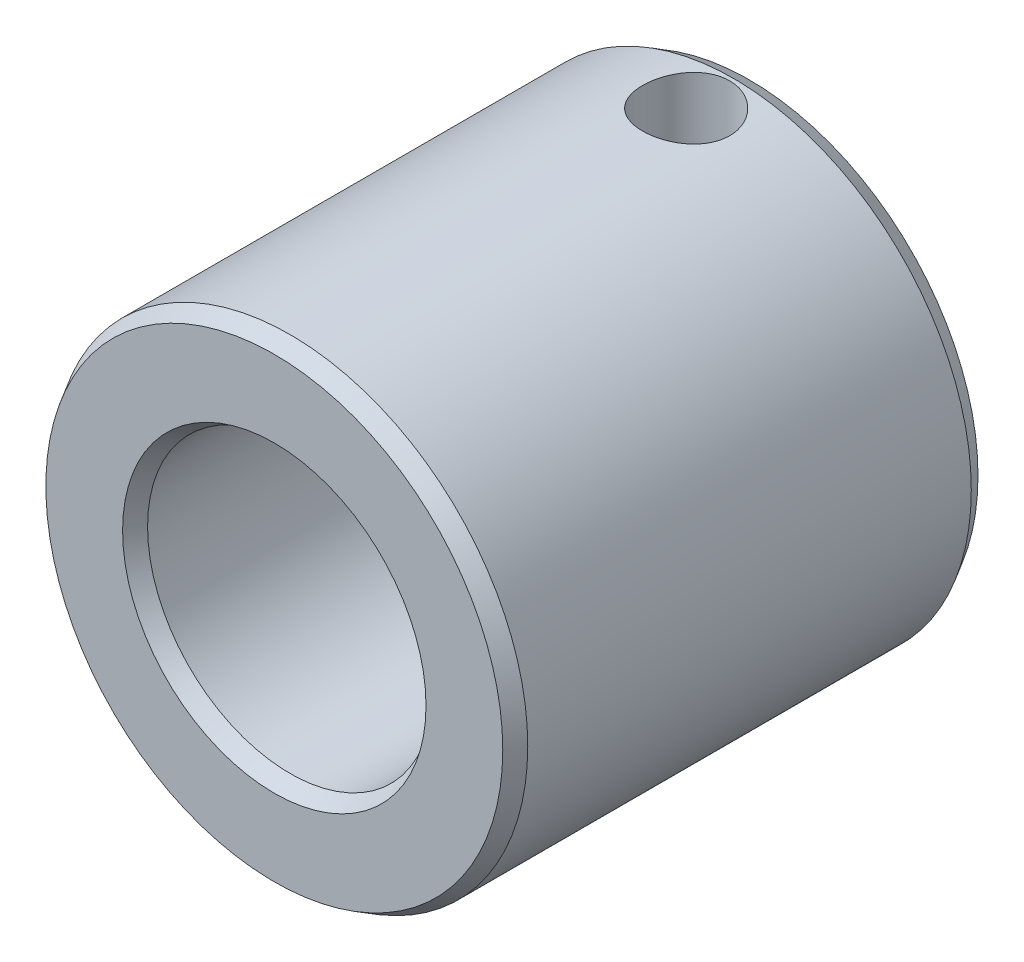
ISO-10303-21;
HEADER;
FILE_DESCRIPTION(('STEP AP214'),'2;1');
FILE_NAME('part.step','',(''),(''),'','','');
FILE_SCHEMA(('AUTOMOTIVE_DESIGN { 1 0 10303 214 1 1 1 1 }'));
ENDSEC;
DATA;
#1=APPLICATION_CONTEXT('core data for automotive mechanical design processes');
#2=APPLICATION_PROTOCOL_DEFINITION('international standard','automotive_design',2000,#1);
#3=PRODUCT_CONTEXT('',#1,'mechanical');
#4=PRODUCT('Part','Part','',(#3));
#5=PRODUCT_RELATED_PRODUCT_CATEGORY('part','',(#4));
#6=PRODUCT_DEFINITION_FORMATION('','',#4);
#7=PRODUCT_DEFINITION_CONTEXT('part definition',#1,'design');
#8=PRODUCT_DEFINITION('design','',#6,#7);
#9=PRODUCT_DEFINITION_SHAPE('','',#8);
#10=(LENGTH_UNIT() NAMED_UNIT(*) SI_UNIT(.MILLI.,.METRE.));
#11=(NAMED_UNIT(*) PLANE_ANGLE_UNIT() SI_UNIT($,.RADIAN.));
#12=(NAMED_UNIT(*) SI_UNIT($,.STERADIAN.) SOLID_ANGLE_UNIT());
#13=UNCERTAINTY_MEASURE_WITH_UNIT(LENGTH_MEASURE(1.E-05),#10,'distance_accuracy_value','');
#14=(GEOMETRIC_REPRESENTATION_CONTEXT(3) GLOBAL_UNCERTAINTY_ASSIGNED_CONTEXT((#13)) GLOBAL_UNIT_ASSIGNED_CONTEXT((#10,
#11,#12)) REPRESENTATION_CONTEXT('',''));
#15=CARTESIAN_POINT('',(0.,0.,0.));
#16=DIRECTION('',(0.,0.,1.));
#17=DIRECTION('',(1.,0.,0.));
#18=AXIS2_PLACEMENT_3D('',#15,#16,#17);
#19=CARTESIAN_POINT('',(0.,0.,35.094868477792));
#20=DIRECTION('',(0.,0.,1.));
#21=DIRECTION('',(1.,0.,0.));
#22=AXIS2_PLACEMENT_3D('',#19,#20,#21);
#23=CYLINDRICAL_SURFACE('',#22,9.);
#24=CARTESIAN_POINT('',(0.,0.,29.));
#25=DIRECTION('',(0.,0.,1.));
#26=DIRECTION('',(1.,0.,0.));
#27=AXIS2_PLACEMENT_3D('',#24,#25,#26);
#28=CIRCLE('',#27,9.);
#29=CARTESIAN_POINT('',(9.,0.,29.));
#30=VERTEX_POINT('',#29);
#31=EDGE_CURVE('E29',#30,#30,#28,.T.);
#32=ORIENTED_EDGE('',*,*,#31,.T.);
#33=EDGE_LOOP('',(#32));
#34=FACE_BOUND('',#33,.T.);
#35=CARTESIAN_POINT('',(0.,0.,1.));
#36=DIRECTION('',(0.,0.,1.));
#37=DIRECTION('',(1.,0.,0.));
#38=AXIS2_PLACEMENT_3D('',#35,#36,#37);
#39=CIRCLE('',#38,9.);
#40=CARTESIAN_POINT('',(9.,0.,1.));
#41=VERTEX_POINT('',#40);
#42=EDGE_CURVE('E34',#41,#41,#39,.T.);
#43=ORIENTED_EDGE('',*,*,#42,.F.);
#44=EDGE_LOOP('',(#43));
#45=FACE_BOUND('',#44,.T.);
#46=CARTESIAN_POINT('',(0.,9.,6.75));
#47=CARTESIAN_POINT('',(0.150732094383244,8.99999893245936,6.74999853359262));
#48=CARTESIAN_POINT('',(0.301479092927,8.9961773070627,6.73756620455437));
#49=CARTESIAN_POINT('',(0.598575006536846,8.98130590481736,6.68828880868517));
#50=CARTESIAN_POINT('',(0.744922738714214,8.97025420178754,6.6514372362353));
#51=CARTESIAN_POINT('',(1.02889246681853,8.94213200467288,6.55467260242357));
#52=CARTESIAN_POINT('',(1.16652725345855,8.92507058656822,6.49479430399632));
#53=CARTESIAN_POINT('',(1.42980304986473,8.88669712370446,6.35382085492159));
#54=CARTESIAN_POINT('',(1.55544232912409,8.86538446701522,6.27272264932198));
#55=CARTESIAN_POINT('',(1.7948886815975,8.82006981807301,6.08907720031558));
#56=CARTESIAN_POINT('',(1.90828973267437,8.79601116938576,5.98601458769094));
#57=CARTESIAN_POINT('',(2.11649716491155,8.74824972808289,5.76246382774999));
#58=CARTESIAN_POINT('',(2.21130027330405,8.72454699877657,5.64197261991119));
#59=CARTESIAN_POINT('',(2.38178581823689,8.67957795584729,5.38351455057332));
#60=CARTESIAN_POINT('',(2.45696755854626,8.658381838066,5.24520405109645));
#61=CARTESIAN_POINT('',(2.58283736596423,8.62167505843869,4.95715067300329));
#62=CARTESIAN_POINT('',(2.63353156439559,8.60616297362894,4.80741066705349));
#63=CARTESIAN_POINT('',(2.70751366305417,8.58317198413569,4.50531810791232));
#64=CARTESIAN_POINT('',(2.73155215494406,8.575473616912,4.35316653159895));
#65=CARTESIAN_POINT('',(2.75388480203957,8.56832938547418,4.04681021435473));
#66=CARTESIAN_POINT('',(2.75218545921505,8.56888143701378,3.89260600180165));
#67=CARTESIAN_POINT('',(2.7236791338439,8.57798150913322,3.59267144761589));
#68=CARTESIAN_POINT('',(2.69781854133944,8.58622811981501,3.44684048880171));
#69=CARTESIAN_POINT('',(2.62325522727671,8.60929961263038,3.16169483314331));
#70=CARTESIAN_POINT('',(2.57455017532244,8.62412516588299,3.02238080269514));
#71=CARTESIAN_POINT('',(2.45499611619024,8.65892040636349,2.75193535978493));
#72=CARTESIAN_POINT('',(2.38384448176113,8.67895969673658,2.62094706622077));
#73=CARTESIAN_POINT('',(2.22162725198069,8.7218917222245,2.37245516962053));
#74=CARTESIAN_POINT('',(2.13055667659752,8.74478517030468,2.25495495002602));
#75=CARTESIAN_POINT('',(1.92641124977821,8.79206258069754,2.03141446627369));
#76=CARTESIAN_POINT('',(1.81255281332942,8.8164681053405,1.92609309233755));
#77=CARTESIAN_POINT('',(1.56848594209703,8.86314096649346,1.73586853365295));
#78=CARTESIAN_POINT('',(1.43827640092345,8.88540815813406,1.6509667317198));
#79=CARTESIAN_POINT('',(1.1638622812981,8.92551194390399,1.50353273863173));
#80=CARTESIAN_POINT('',(1.01956405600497,8.94331562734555,1.44116529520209));
#81=CARTESIAN_POINT('',(0.721855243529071,8.9722490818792,1.34179925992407));
#82=CARTESIAN_POINT('',(0.56844731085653,8.98338078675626,1.30479331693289));
#83=CARTESIAN_POINT('',(0.2629811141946,8.99740784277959,1.2584097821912));
#84=CARTESIAN_POINT('',(0.111083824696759,9.00059336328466,1.24805837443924));
#85=CARTESIAN_POINT('',(-0.192290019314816,8.99922345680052,1.25254115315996));
#86=CARTESIAN_POINT('',(-0.343766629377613,8.99466910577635,1.26737183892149));
#87=CARTESIAN_POINT('',(-0.638288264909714,8.97852146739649,1.32101283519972));
#88=CARTESIAN_POINT('',(-0.781447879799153,8.96709666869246,1.35924953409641));
#89=CARTESIAN_POINT('',(-1.05928473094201,8.93853661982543,1.45792271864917));
#90=CARTESIAN_POINT('',(-1.19396093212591,8.92140067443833,1.51836190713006));
#91=CARTESIAN_POINT('',(-1.45455502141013,8.88268238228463,1.6613294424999));
#92=CARTESIAN_POINT('',(-1.58018976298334,8.86100429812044,1.74434726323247));
#93=CARTESIAN_POINT('',(-1.81607444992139,8.81568626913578,1.92952405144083));
#94=CARTESIAN_POINT('',(-1.92632038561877,8.79204581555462,2.03168799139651));
#95=CARTESIAN_POINT('',(-2.13261647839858,8.7443462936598,2.25683479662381));
#96=CARTESIAN_POINT('',(-2.22797320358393,8.72030513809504,2.38045823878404));
#97=CARTESIAN_POINT('',(-2.3966426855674,8.67546813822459,2.64247476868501));
#98=CARTESIAN_POINT('',(-2.46995592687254,8.65467222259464,2.78086753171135));
#99=CARTESIAN_POINT('',(-2.59197431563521,8.61891634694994,3.06811811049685));
#100=CARTESIAN_POINT('',(-2.64078616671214,8.60393114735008,3.21692727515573));
#101=CARTESIAN_POINT('',(-2.71250039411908,8.58159540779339,3.52119990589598));
#102=CARTESIAN_POINT('',(-2.7354120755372,8.57424212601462,3.67666096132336));
#103=CARTESIAN_POINT('',(-2.75402711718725,8.56827980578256,3.98260089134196));
#104=CARTESIAN_POINT('',(-2.75086398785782,8.56930645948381,4.13300457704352));
#105=CARTESIAN_POINT('',(-2.72013837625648,8.57910842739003,4.43102834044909));
#106=CARTESIAN_POINT('',(-2.69257694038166,8.58788340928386,4.57864853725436));
#107=CARTESIAN_POINT('',(-2.61458088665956,8.61194440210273,4.86498559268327));
#108=CARTESIAN_POINT('',(-2.5644570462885,8.62714178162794,5.0037951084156));
#109=CARTESIAN_POINT('',(-2.44300207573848,8.66231608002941,5.27114514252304));
#110=CARTESIAN_POINT('',(-2.37166677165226,8.68229393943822,5.39968363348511));
#111=CARTESIAN_POINT('',(-2.20667281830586,8.72571614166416,5.64807568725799));
#112=CARTESIAN_POINT('',(-2.11227528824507,8.74926262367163,5.76742056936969));
#113=CARTESIAN_POINT('',(-1.90515328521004,8.79668470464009,5.98894305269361));
#114=CARTESIAN_POINT('',(-1.79242399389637,8.82056038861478,6.0911161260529));
#115=CARTESIAN_POINT('',(-1.547669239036,8.86683031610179,6.27852900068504));
#116=CARTESIAN_POINT('',(-1.41515737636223,8.88915651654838,6.36315217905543));
#117=CARTESIAN_POINT('',(-1.13710535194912,8.92897904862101,6.50880379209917));
#118=CARTESIAN_POINT('',(-0.991570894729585,8.94647748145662,6.56984249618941));
#119=CARTESIAN_POINT('',(-0.706221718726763,8.97328009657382,6.66157536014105));
#120=CARTESIAN_POINT('',(-0.567225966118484,8.9832154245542,6.69464227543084));
#121=CARTESIAN_POINT('',(-0.285490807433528,8.99657528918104,6.73885329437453));
#122=CARTESIAN_POINT('',(-0.142752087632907,9.00000101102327,6.75000138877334));
#123=CARTESIAN_POINT('',(0.,9.,6.75));
#124=B_SPLINE_CURVE_WITH_KNOTS('',3,(#46,#47,#48,#49,#50,#51,#52,#53,#54,#55,#56,#57,#58,#59,
#60,#61,#62,#63,#64,#65,#66,#67,#68,#69,#70,#71,#72,#73,#74,#75,#76,#77,#78,#79,#80,#81,#82,#83,
#84,#85,#86,#87,#88,#89,#90,#91,#92,#93,#94,#95,#96,#97,#98,#99,#100,#101,#102,#103,#104,#105,
#106,#107,#108,#109,#110,#111,#112,#113,#114,#115,#116,#117,#118,#119,#120,#121,#122,#123),
.UNSPECIFIED.,.T.,.F.,(4,2,2,2,2,2,2,2,2,2,2,2,2,2,2,2,2,2,2,2,2,2,2,2,2,2,2,2,2,2,2,2,2,2,2,2,
2,2,4),(0.,0.451671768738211,0.903463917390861,1.3545766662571,1.80575439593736,
2.26899159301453,2.73231023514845,3.20649731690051,3.68056560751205,4.14091608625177,
4.60115027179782,5.04408074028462,5.48705640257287,5.93627973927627,6.38561551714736,
6.85445681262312,7.3233298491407,7.79556456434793,8.26766234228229,8.72225023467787,
9.17677493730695,9.62058331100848,10.0644457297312,10.518825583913,10.973323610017,
11.444987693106,11.9166414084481,12.3862228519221,12.8556355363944,13.3047534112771,
13.7538520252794,14.1969455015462,14.6401262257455,15.0999803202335,15.5599554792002,
16.0340612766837,16.5079604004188,16.9357978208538,17.3635573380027),.UNSPECIFIED.);
#125=CARTESIAN_POINT('',(0.,9.,6.75));
#126=VERTEX_POINT('',#125);
#127=EDGE_CURVE('E49',#126,#126,#124,.T.);
#128=ORIENTED_EDGE('',*,*,#127,.T.);
#129=EDGE_LOOP('',(#128));
#130=FACE_BOUND('',#129,.T.);
#131=ADVANCED_FACE('F12',(#34,#45,#130),#23,.F.);
#132=CARTESIAN_POINT('',(0.,0.,35.094868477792));
#133=DIRECTION('',(0.,0.,1.));
#134=DIRECTION('',(1.,0.,0.));
#135=AXIS2_PLACEMENT_3D('',#132,#133,#134);
#136=CYLINDRICAL_SURFACE('',#135,15.);
#137=CARTESIAN_POINT('',(0.,0.,29.));
#138=DIRECTION('',(0.,0.,1.));
#139=DIRECTION('',(1.,0.,0.));
#140=AXIS2_PLACEMENT_3D('',#137,#138,#139);
#141=CIRCLE('',#140,15.);
#142=CARTESIAN_POINT('',(15.,0.,29.));
#143=VERTEX_POINT('',#142);
#144=EDGE_CURVE('E46',#143,#143,#141,.T.);
#145=ORIENTED_EDGE('',*,*,#144,.F.);
#146=EDGE_LOOP('',(#145));
#147=FACE_BOUND('',#146,.T.);
#148=CARTESIAN_POINT('',(0.,0.,1.));
#149=DIRECTION('',(0.,0.,1.));
#150=DIRECTION('',(1.,0.,0.));
#151=AXIS2_PLACEMENT_3D('',#148,#149,#150);
#152=CIRCLE('',#151,15.);
#153=CARTESIAN_POINT('',(15.,0.,1.));
#154=VERTEX_POINT('',#153);
#155=EDGE_CURVE('E43',#154,#154,#152,.T.);
#156=ORIENTED_EDGE('',*,*,#155,.T.);
#157=EDGE_LOOP('',(#156));
#158=FACE_BOUND('',#157,.T.);
#159=CARTESIAN_POINT('',(0.,15.,6.75));
#160=CARTESIAN_POINT('',(-0.153093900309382,14.9999972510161,6.74999408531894));
#161=CARTESIAN_POINT('',(-0.30626547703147,14.9976319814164,6.73717257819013));
#162=CARTESIAN_POINT('',(-0.608296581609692,14.9884243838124,6.68625588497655));
#163=CARTESIAN_POINT('',(-0.757152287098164,14.9815782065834,6.64813896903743));
#164=CARTESIAN_POINT('',(-1.04613957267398,14.9641750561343,6.54783432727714));
#165=CARTESIAN_POINT('',(-1.18627875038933,14.9536213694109,6.48566791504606));
#166=CARTESIAN_POINT('',(-1.45412377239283,14.9299573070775,6.3390885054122));
#167=CARTESIAN_POINT('',(-1.58183070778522,14.9168471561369,6.25467746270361));
#168=CARTESIAN_POINT('',(-1.82266517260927,14.8893503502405,6.06497648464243));
#169=CARTESIAN_POINT('',(-1.93562942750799,14.8749519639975,5.95948094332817));
#170=CARTESIAN_POINT('',(-2.1423598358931,14.846589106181,5.73104795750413));
#171=CARTESIAN_POINT('',(-2.23612464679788,14.8326246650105,5.60810929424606));
#172=CARTESIAN_POINT('',(-2.40246850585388,14.806596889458,5.34713263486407));
#173=CARTESIAN_POINT('',(-2.47488242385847,14.7945486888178,5.20898774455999));
#174=CARTESIAN_POINT('',(-2.59541207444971,14.7738823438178,4.922235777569));
#175=CARTESIAN_POINT('',(-2.64352980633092,14.7652639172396,4.77362956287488));
#176=CARTESIAN_POINT('',(-2.71357916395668,14.7525507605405,4.47191708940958));
#177=CARTESIAN_POINT('',(-2.73579495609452,14.7484069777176,4.31887891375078));
#178=CARTESIAN_POINT('',(-2.75429164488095,14.7449642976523,4.01119549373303));
#179=CARTESIAN_POINT('',(-2.75057476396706,14.7456649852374,3.8565503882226));
#180=CARTESIAN_POINT('',(-2.71754225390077,14.7517873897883,3.55209529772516));
#181=CARTESIAN_POINT('',(-2.68854893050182,14.7571496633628,3.40224897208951));
#182=CARTESIAN_POINT('',(-2.60629376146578,14.7718977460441,3.1095840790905));
#183=CARTESIAN_POINT('',(-2.55303092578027,14.7812837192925,2.96676579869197));
#184=CARTESIAN_POINT('',(-2.42343106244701,14.8030842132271,2.69126347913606));
#185=CARTESIAN_POINT('',(-2.34696312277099,14.8155158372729,2.5586424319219));
#186=CARTESIAN_POINT('',(-2.17321635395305,14.841995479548,2.3079923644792));
#187=CARTESIAN_POINT('',(-2.0759355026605,14.8560436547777,2.18996476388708));
#188=CARTESIAN_POINT('',(-1.86158278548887,14.8844329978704,1.96998902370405));
#189=CARTESIAN_POINT('',(-1.74423505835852,14.8987753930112,1.86830966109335));
#190=CARTESIAN_POINT('',(-1.4940048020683,14.925942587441,1.68604048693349));
#191=CARTESIAN_POINT('',(-1.36112212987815,14.9387673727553,1.6054508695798));
#192=CARTESIAN_POINT('',(-1.08331945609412,14.9614785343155,1.46761241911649));
#193=CARTESIAN_POINT('',(-0.938385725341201,14.9713614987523,1.4103906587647));
#194=CARTESIAN_POINT('',(-0.640742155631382,14.9870489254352,1.32117929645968));
#195=CARTESIAN_POINT('',(-0.488033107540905,14.9928538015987,1.28918713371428));
#196=CARTESIAN_POINT('',(-0.1814870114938,14.999674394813,1.25171517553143));
#197=CARTESIAN_POINT('',(-0.0276964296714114,15.0007566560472,1.24586696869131));
#198=CARTESIAN_POINT('',(0.278665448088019,14.9981935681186,1.25986196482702));
#199=CARTESIAN_POINT('',(0.431236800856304,14.9945484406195,1.27970396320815));
#200=CARTESIAN_POINT('',(0.729667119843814,14.9829815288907,1.34420979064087));
#201=CARTESIAN_POINT('',(0.875567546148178,14.9750917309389,1.38868804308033));
#202=CARTESIAN_POINT('',(1.15784057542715,14.9559164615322,1.501003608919));
#203=CARTESIAN_POINT('',(1.2942125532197,14.9446307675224,1.56884245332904));
#204=CARTESIAN_POINT('',(1.55513574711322,14.9197496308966,1.72677482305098));
#205=CARTESIAN_POINT('',(1.67954783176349,14.9061311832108,1.81709451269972));
#206=CARTESIAN_POINT('',(1.91158174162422,14.8781564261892,2.01711764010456));
#207=CARTESIAN_POINT('',(2.01920207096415,14.8638000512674,2.12682280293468));
#208=CARTESIAN_POINT('',(2.21599031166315,14.8357478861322,2.36416748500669));
#209=CARTESIAN_POINT('',(2.30490730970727,14.8220627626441,2.49201651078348));
#210=CARTESIAN_POINT('',(2.46000320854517,14.7971139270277,2.76105288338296));
#211=CARTESIAN_POINT('',(2.52618293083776,14.7858501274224,2.90223974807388));
#212=CARTESIAN_POINT('',(2.63356582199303,14.7671022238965,3.19329356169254));
#213=CARTESIAN_POINT('',(2.67488605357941,14.7596004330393,3.34311612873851));
#214=CARTESIAN_POINT('',(2.73173972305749,14.7491846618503,3.64772693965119));
#215=CARTESIAN_POINT('',(2.74727592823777,14.746270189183,3.80251464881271));
#216=CARTESIAN_POINT('',(2.75203112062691,14.7453832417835,4.11015028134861));
#217=CARTESIAN_POINT('',(2.74164570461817,14.7473364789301,4.26299201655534));
#218=CARTESIAN_POINT('',(2.69571632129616,14.7558005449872,4.56471215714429));
#219=CARTESIAN_POINT('',(2.66017248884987,14.7623113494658,4.71359058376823));
#220=CARTESIAN_POINT('',(2.56509900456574,14.77912629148,5.00295766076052));
#221=CARTESIAN_POINT('',(2.50561036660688,14.7894239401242,5.14346018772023));
#222=CARTESIAN_POINT('',(2.36437859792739,14.8126571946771,5.41255379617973));
#223=CARTESIAN_POINT('',(2.28263399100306,14.8255929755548,5.54114408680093));
#224=CARTESIAN_POINT('',(2.09782771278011,14.8528765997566,5.78474827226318));
#225=CARTESIAN_POINT('',(1.99447745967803,14.8672420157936,5.89954130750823));
#226=CARTESIAN_POINT('',(1.76999701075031,14.8956330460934,6.11028811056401));
#227=CARTESIAN_POINT('',(1.64886273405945,14.9096585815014,6.20623754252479));
#228=CARTESIAN_POINT('',(1.39101348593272,14.9359299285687,6.37733686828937));
#229=CARTESIAN_POINT('',(1.25417414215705,14.9481594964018,6.45230189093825));
#230=CARTESIAN_POINT('',(0.969665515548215,14.9693025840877,6.57805965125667));
#231=CARTESIAN_POINT('',(0.822006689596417,14.9782192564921,6.62887538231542));
#232=CARTESIAN_POINT('',(0.561569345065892,14.9898870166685,6.69442423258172));
#233=CARTESIAN_POINT('',(0.450325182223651,14.9936582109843,6.71523000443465));
#234=CARTESIAN_POINT('',(0.226068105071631,14.9987156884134,6.74301990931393));
#235=CARTESIAN_POINT('',(0.11305523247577,15.0000020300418,6.75000436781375));
#236=CARTESIAN_POINT('',(0.,15.,6.75));
#237=B_SPLINE_CURVE_WITH_KNOTS('',3,(#159,#160,#161,#162,#163,#164,#165,#166,#167,#168,#169,
#170,#171,#172,#173,#174,#175,#176,#177,#178,#179,#180,#181,#182,#183,#184,#185,#186,#187,#188,
#189,#190,#191,#192,#193,#194,#195,#196,#197,#198,#199,#200,#201,#202,#203,#204,#205,#206,#207,
#208,#209,#210,#211,#212,#213,#214,#215,#216,#217,#218,#219,#220,#221,#222,#223,#224,#225,#226,
#227,#228,#229,#230,#231,#232,#233,#234,#235,#236),.UNSPECIFIED.,.T.,.F.,(4,2,2,2,2,2,2,2,2,2,2,
2,2,2,2,2,2,2,2,2,2,2,2,2,2,2,2,2,2,2,2,2,2,2,2,2,2,2,4),(0.,0.458868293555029,
0.918131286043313,1.3769881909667,1.83580478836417,2.29933541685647,2.76289844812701,
3.229957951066,3.69697901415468,4.15882675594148,4.62063491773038,5.07663918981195,
5.53266206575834,5.99130700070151,6.44999651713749,6.91559042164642,7.38118861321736,
7.84732470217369,8.31341347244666,8.77291314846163,9.23239127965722,9.68845448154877,
10.1445475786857,10.6054289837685,11.0663514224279,11.5331103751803,11.9998524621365,
12.4643791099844,12.9288558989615,13.3862876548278,13.8437169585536,14.3003660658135,
14.757045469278,15.2202665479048,15.6835940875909,16.1508835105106,16.6177271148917,
16.956595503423,17.2954559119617),.UNSPECIFIED.);
#238=CARTESIAN_POINT('',(0.,15.,6.75));
#239=VERTEX_POINT('',#238);
#240=EDGE_CURVE('E16',#239,#239,#237,.T.);
#241=ORIENTED_EDGE('',*,*,#240,.T.);
#242=EDGE_LOOP('',(#241));
#243=FACE_BOUND('',#242,.T.);
#244=ADVANCED_FACE('F63',(#147,#158,#243),#136,.T.);
#245=CARTESIAN_POINT('',(0.,0.,29.));
#246=DIRECTION('',(0.,0.,-1.));
#247=DIRECTION('',(-1.,0.,0.));
#248=AXIS2_PLACEMENT_3D('',#245,#246,#247);
#249=CONICAL_SURFACE('',#248,15.,0.523598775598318);
#250=CARTESIAN_POINT('',(0.,0.,30.));
#251=DIRECTION('',(0.,0.,1.));
#252=DIRECTION('',(1.,0.,0.));
#253=AXIS2_PLACEMENT_3D('',#250,#251,#252);
#254=CIRCLE('',#253,14.4226497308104);
#255=CARTESIAN_POINT('',(14.4226497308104,0.,30.));
#256=VERTEX_POINT('',#255);
#257=EDGE_CURVE('E8',#256,#256,#254,.T.);
#258=ORIENTED_EDGE('',*,*,#257,.F.);
#259=EDGE_LOOP('',(#258));
#260=FACE_BOUND('',#259,.T.);
#261=ORIENTED_EDGE('',*,*,#144,.T.);
#262=EDGE_LOOP('',(#261));
#263=FACE_BOUND('',#262,.T.);
#264=ADVANCED_FACE('F14',(#260,#263),#249,.T.);
#265=CARTESIAN_POINT('',(0.,-9.57735026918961,30.));
#266=DIRECTION('',(0.,0.,1.));
#267=DIRECTION('',(1.,0.,0.));
#268=AXIS2_PLACEMENT_3D('',#265,#266,#267);
#269=PLANE('',#268);
#270=ORIENTED_EDGE('',*,*,#257,.T.);
#271=EDGE_LOOP('',(#270));
#272=FACE_BOUND('',#271,.T.);
#273=CARTESIAN_POINT('',(0.,0.,30.));
#274=DIRECTION('',(0.,0.,1.));
#275=DIRECTION('',(1.,0.,0.));
#276=AXIS2_PLACEMENT_3D('',#273,#274,#275);
#277=CIRCLE('',#276,9.57735026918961);
#278=CARTESIAN_POINT('',(9.57735026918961,0.,30.));
#279=VERTEX_POINT('',#278);
#280=EDGE_CURVE('E25',#279,#279,#277,.T.);
#281=ORIENTED_EDGE('',*,*,#280,.F.);
#282=EDGE_LOOP('',(#281));
#283=FACE_BOUND('',#282,.T.);
#284=ADVANCED_FACE('F84',(#272,#283),#269,.T.);
#285=CARTESIAN_POINT('',(0.,0.,29.));
#286=DIRECTION('',(0.,0.,1.));
#287=DIRECTION('',(1.,0.,0.));
#288=AXIS2_PLACEMENT_3D('',#285,#286,#287);
#289=CONICAL_SURFACE('',#288,9.,0.523598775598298);
#290=ORIENTED_EDGE('',*,*,#280,.T.);
#291=EDGE_LOOP('',(#290));
#292=FACE_BOUND('',#291,.T.);
#293=ORIENTED_EDGE('',*,*,#31,.F.);
#294=EDGE_LOOP('',(#293));
#295=FACE_BOUND('',#294,.T.);
#296=ADVANCED_FACE('F77',(#292,#295),#289,.F.);
#297=CARTESIAN_POINT('',(0.,0.,1.));
#298=DIRECTION('',(0.,0.,-1.));
#299=DIRECTION('',(-1.,0.,0.));
#300=AXIS2_PLACEMENT_3D('',#297,#298,#299);
#301=CONICAL_SURFACE('',#300,9.,0.523598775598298);
#302=CARTESIAN_POINT('',(0.,0.,0.));
#303=DIRECTION('',(0.,0.,1.));
#304=DIRECTION('',(1.,0.,0.));
#305=AXIS2_PLACEMENT_3D('',#302,#303,#304);
#306=CIRCLE('',#305,9.57735026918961);
#307=CARTESIAN_POINT('',(9.57735026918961,0.,0.));
#308=VERTEX_POINT('',#307);
#309=EDGE_CURVE('E37',#308,#308,#306,.T.);
#310=ORIENTED_EDGE('',*,*,#309,.F.);
#311=EDGE_LOOP('',(#310));
#312=FACE_BOUND('',#311,.T.);
#313=ORIENTED_EDGE('',*,*,#42,.T.);
#314=EDGE_LOOP('',(#313));
#315=FACE_BOUND('',#314,.T.);
#316=ADVANCED_FACE('F74',(#312,#315),#301,.F.);
#317=CARTESIAN_POINT('',(0.,-14.4226497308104,0.));
#318=DIRECTION('',(0.,0.,-1.));
#319=DIRECTION('',(-1.,0.,0.));
#320=AXIS2_PLACEMENT_3D('',#317,#318,#319);
#321=PLANE('',#320);
#322=ORIENTED_EDGE('',*,*,#309,.T.);
#323=EDGE_LOOP('',(#322));
#324=FACE_BOUND('',#323,.T.);
#325=CARTESIAN_POINT('',(0.,0.,0.));
#326=DIRECTION('',(0.,0.,1.));
#327=DIRECTION('',(1.,0.,0.));
#328=AXIS2_PLACEMENT_3D('',#325,#326,#327);
#329=CIRCLE('',#328,14.4226497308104);
#330=CARTESIAN_POINT('',(14.4226497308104,0.,0.));
#331=VERTEX_POINT('',#330);
#332=EDGE_CURVE('E40',#331,#331,#329,.T.);
#333=ORIENTED_EDGE('',*,*,#332,.F.);
#334=EDGE_LOOP('',(#333));
#335=FACE_BOUND('',#334,.T.);
#336=ADVANCED_FACE('F71',(#324,#335),#321,.T.);
#337=CARTESIAN_POINT('',(0.,0.,1.));
#338=DIRECTION('',(0.,0.,1.));
#339=DIRECTION('',(1.,0.,0.));
#340=AXIS2_PLACEMENT_3D('',#337,#338,#339);
#341=CONICAL_SURFACE('',#340,15.,0.523598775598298);
#342=ORIENTED_EDGE('',*,*,#332,.T.);
#343=EDGE_LOOP('',(#342));
#344=FACE_BOUND('',#343,.T.);
#345=ORIENTED_EDGE('',*,*,#155,.F.);
#346=EDGE_LOOP('',(#345));
#347=FACE_BOUND('',#346,.T.);
#348=ADVANCED_FACE('F61',(#344,#347),#341,.T.);
#349=CARTESIAN_POINT('',(0.,20.,4.));
#350=DIRECTION('',(0.,-1.,0.));
#351=DIRECTION('',(0.,0.,1.));
#352=AXIS2_PLACEMENT_3D('',#349,#350,#351);
#353=CYLINDRICAL_SURFACE('',#352,2.75);
#354=ORIENTED_EDGE('',*,*,#127,.F.);
#355=EDGE_LOOP('',(#354));
#356=FACE_BOUND('',#355,.T.);
#357=ORIENTED_EDGE('',*,*,#240,.F.);
#358=EDGE_LOOP('',(#357));
#359=FACE_BOUND('',#358,.T.);
#360=ADVANCED_FACE('F58',(#356,#359),#353,.F.);
#361=CLOSED_SHELL('',(#131,#244,#264,#284,#296,#316,#336,#348,#360));
#362=MANIFOLD_SOLID_BREP('B1',#361);
#363=ADVANCED_BREP_SHAPE_REPRESENTATION('',(#18,#362),#14);
#364=SHAPE_DEFINITION_REPRESENTATION(#9,#363);
ENDSEC;
END-ISO-10303-21;
